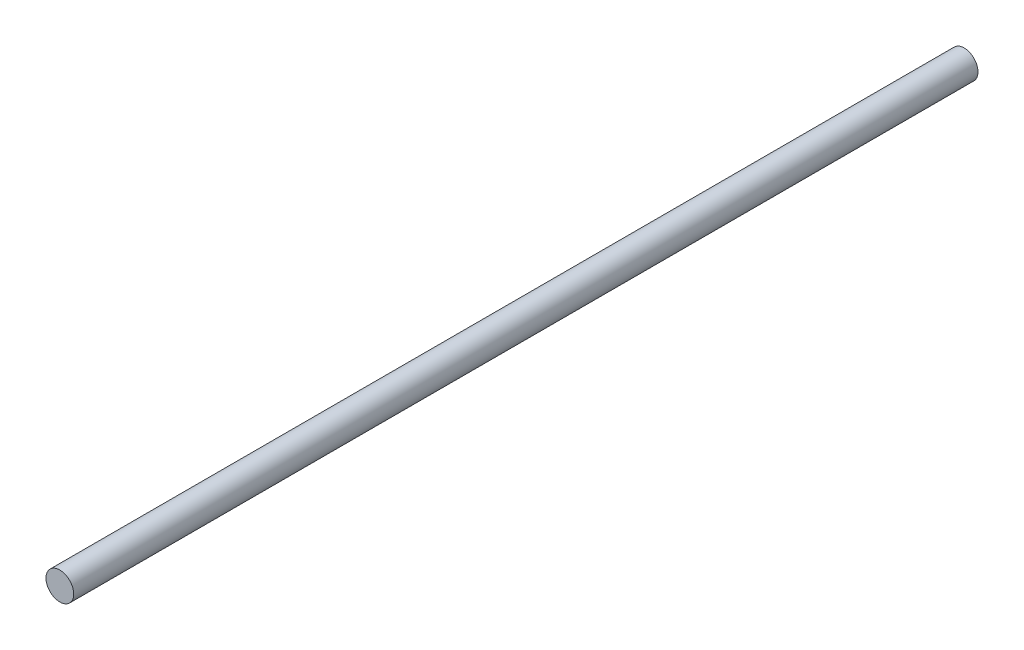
ISO-10303-21;
HEADER;
FILE_DESCRIPTION(('STEP AP214'),'2;1');
FILE_NAME('part.step','',(''),(''),'','','');
FILE_SCHEMA(('AUTOMOTIVE_DESIGN { 1 0 10303 214 1 1 1 1 }'));
ENDSEC;
DATA;
#1=APPLICATION_CONTEXT('core data for automotive mechanical design processes');
#2=APPLICATION_PROTOCOL_DEFINITION('international standard','automotive_design',2000,#1);
#3=PRODUCT_CONTEXT('',#1,'mechanical');
#4=PRODUCT('Part','Part','',(#3));
#5=PRODUCT_RELATED_PRODUCT_CATEGORY('part','',(#4));
#6=PRODUCT_DEFINITION_FORMATION('','',#4);
#7=PRODUCT_DEFINITION_CONTEXT('part definition',#1,'design');
#8=PRODUCT_DEFINITION('design','',#6,#7);
#9=PRODUCT_DEFINITION_SHAPE('','',#8);
#10=(LENGTH_UNIT() NAMED_UNIT(*) SI_UNIT(.MILLI.,.METRE.));
#11=(NAMED_UNIT(*) PLANE_ANGLE_UNIT() SI_UNIT($,.RADIAN.));
#12=(NAMED_UNIT(*) SI_UNIT($,.STERADIAN.) SOLID_ANGLE_UNIT());
#13=UNCERTAINTY_MEASURE_WITH_UNIT(LENGTH_MEASURE(1.E-05),#10,'distance_accuracy_value','');
#14=(GEOMETRIC_REPRESENTATION_CONTEXT(3) GLOBAL_UNCERTAINTY_ASSIGNED_CONTEXT((#13)) GLOBAL_UNIT_ASSIGNED_CONTEXT((#10,
#11,#12)) REPRESENTATION_CONTEXT('',''));
#15=CARTESIAN_POINT('',(0.,0.,0.));
#16=DIRECTION('',(0.,0.,1.));
#17=DIRECTION('',(1.,0.,0.));
#18=AXIS2_PLACEMENT_3D('',#15,#16,#17);
#19=CARTESIAN_POINT('',(0.,0.,325.));
#20=DIRECTION('',(0.,0.,-1.));
#21=DIRECTION('',(-1.,0.,0.));
#22=AXIS2_PLACEMENT_3D('',#19,#20,#21);
#23=CYLINDRICAL_SURFACE('',#22,9.96173699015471);
#24=CARTESIAN_POINT('',(0.,0.,325.));
#25=DIRECTION('',(0.,0.,1.));
#26=DIRECTION('',(1.,0.,0.));
#27=AXIS2_PLACEMENT_3D('',#24,#25,#26);
#28=CIRCLE('',#27,9.96173699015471);
#29=CARTESIAN_POINT('',(9.96173699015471,0.,325.));
#30=VERTEX_POINT('',#29);
#31=EDGE_CURVE('E10',#30,#30,#28,.T.);
#32=ORIENTED_EDGE('',*,*,#31,.F.);
#33=EDGE_LOOP('',(#32));
#34=FACE_BOUND('',#33,.T.);
#35=CARTESIAN_POINT('',(0.,0.,-325.));
#36=DIRECTION('',(0.,0.,1.));
#37=DIRECTION('',(1.,0.,0.));
#38=AXIS2_PLACEMENT_3D('',#35,#36,#37);
#39=CIRCLE('',#38,9.96173699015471);
#40=CARTESIAN_POINT('',(9.96173699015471,0.,-325.));
#41=VERTEX_POINT('',#40);
#42=EDGE_CURVE('E35',#41,#41,#39,.T.);
#43=ORIENTED_EDGE('',*,*,#42,.T.);
#44=EDGE_LOOP('',(#43));
#45=FACE_BOUND('',#44,.T.);
#46=ADVANCED_FACE('F32',(#34,#45),#23,.T.);
#47=CARTESIAN_POINT('',(0.,0.,325.));
#48=DIRECTION('',(0.,0.,1.));
#49=DIRECTION('',(1.,0.,0.));
#50=AXIS2_PLACEMENT_3D('',#47,#48,#49);
#51=PLANE('',#50);
#52=ORIENTED_EDGE('',*,*,#31,.T.);
#53=EDGE_LOOP('',(#52));
#54=FACE_BOUND('',#53,.T.);
#55=ADVANCED_FACE('F47',(#54),#51,.T.);
#56=CARTESIAN_POINT('',(0.,0.,-325.));
#57=DIRECTION('',(0.,0.,1.));
#58=DIRECTION('',(1.,0.,0.));
#59=AXIS2_PLACEMENT_3D('',#56,#57,#58);
#60=PLANE('',#59);
#61=ORIENTED_EDGE('',*,*,#42,.F.);
#62=EDGE_LOOP('',(#61));
#63=FACE_BOUND('',#62,.T.);
#64=ADVANCED_FACE('F45',(#63),#60,.F.);
#65=CLOSED_SHELL('',(#46,#55,#64));
#66=MANIFOLD_SOLID_BREP('B2',#65);
#67=ADVANCED_BREP_SHAPE_REPRESENTATION('',(#18,#66),#14);
#68=SHAPE_DEFINITION_REPRESENTATION(#9,#67);
ENDSEC;
END-ISO-10303-21;
